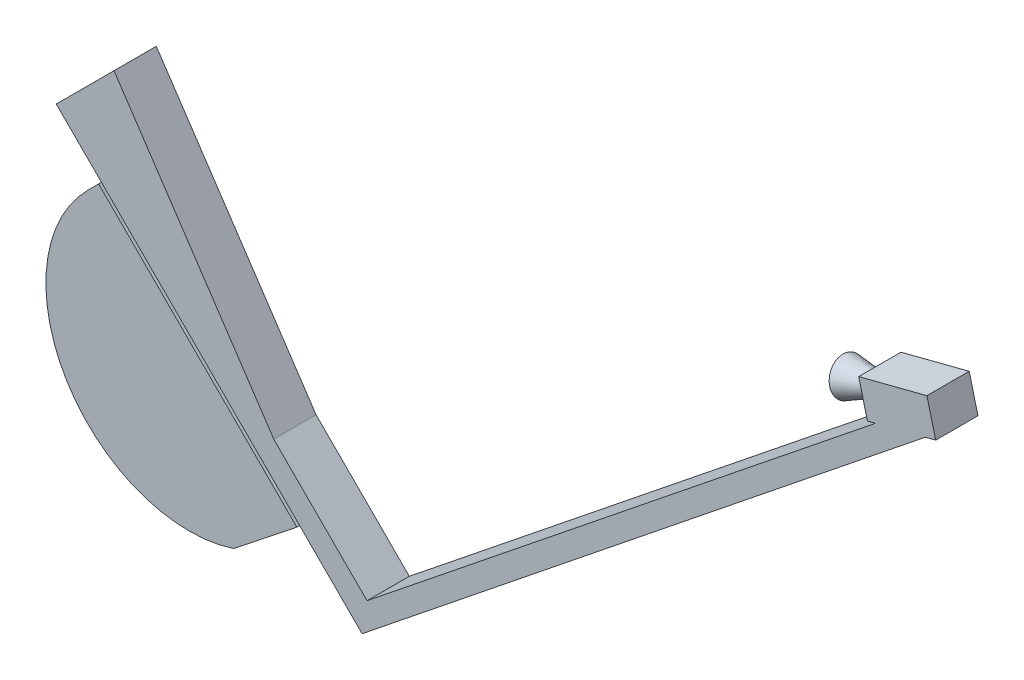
from build123d import *

# Parameters (mm, degrees)
BOSS_EXTRUDE1_DEPTH = 38.1
BOSS_EXTRUDE2_DEPTH = 5


with BuildPart() as part:
    # Sketch1 → Boss-Extrude1 (new, symmetric)
    with BuildSketch(Plane.XY):
        Polygon((0, 0), (168.048490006, -168.048490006), (1084.208057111, 566.838316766), (1069.78369163, 563.115899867), (1053.916437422, 624.601509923), (1176.887657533, 656.336018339), (1192.754911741, 594.850408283), (1173.9803154, 590.005351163), (159.136338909, -224.040013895), (-391.927027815, 327.023352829), (-287.849814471, 431.100566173), align=None)
    extrude(amount=BOSS_EXTRUDE1_DEPTH, both=True)

    # Sketch2 → Revolve1 (revolve)
    with BuildSketch(Plane.XY, mode=Mode.PRIVATE) as revolve1_sk:
        Polygon((1058.285052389, 607.673126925), (987.583181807, 607.673126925), (995.562749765, 576.752301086), (1061.850064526, 593.858704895), align=None)
    revolve(revolve1_sk.sketch.rotate(Axis((995.562749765, 576.752301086, 0), (0.9682773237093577, 0.24987801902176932, 0)), 180), axis=Axis((995.562749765, 576.752301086, 0), (0.9682773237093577, 0.24987801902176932, 0)))


with BuildPart() as body_2:
    # Sketch3 → Boss-Extrude2 (new body)
    with BuildSketch(Plane.XY.offset(38.1)):
        with BuildLine():
            Line((-310.477036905, 245.573361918), (-329.96526454, 226.085134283))
            ThreePointArc((-329.96526454, 226.085134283), (-367.423161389, -91.514487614), (-67.25233567, -201.832615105))
            Line((-67.25233567, -201.832615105), (46.638646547, -111.542321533))
            Line((46.638646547, -111.542321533), (-310.477036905, 245.573361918))
        make_face()
    extrude(amount=BOSS_EXTRUDE2_DEPTH)


solid = Compound([part.part, body_2.part])
